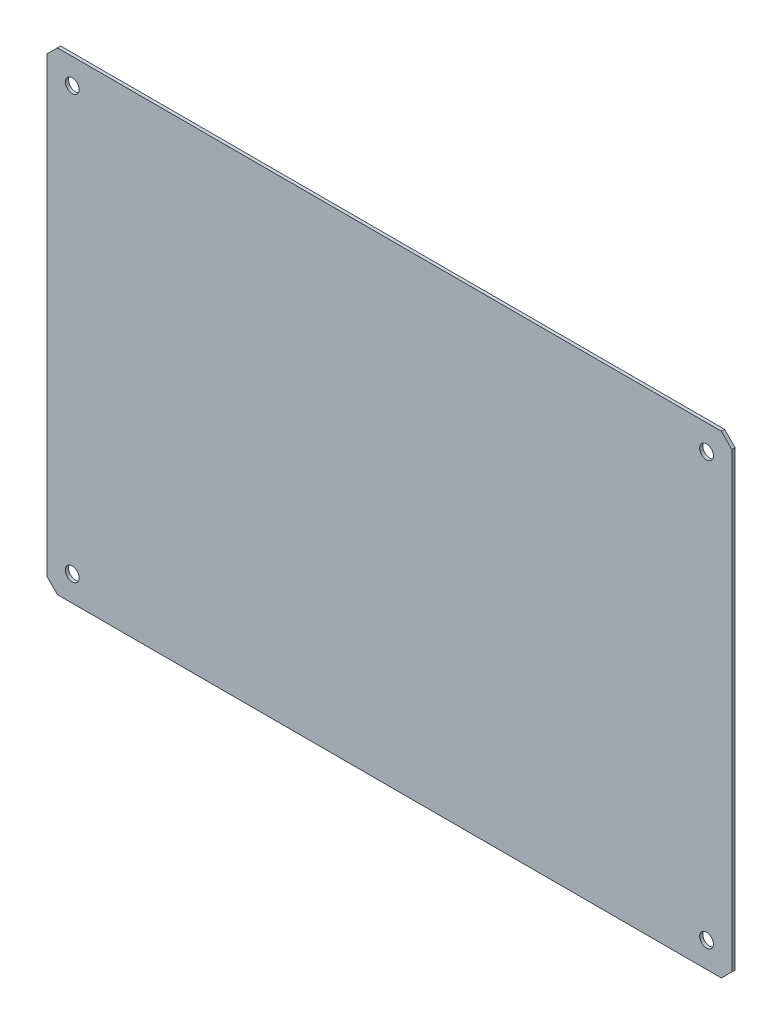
ISO-10303-21;
HEADER;
FILE_DESCRIPTION(('STEP AP214'),'2;1');
FILE_NAME('part.step','',(''),(''),'','','');
FILE_SCHEMA(('AUTOMOTIVE_DESIGN { 1 0 10303 214 1 1 1 1 }'));
ENDSEC;
DATA;
#1=APPLICATION_CONTEXT('core data for automotive mechanical design processes');
#2=APPLICATION_PROTOCOL_DEFINITION('international standard','automotive_design',2000,#1);
#3=PRODUCT_CONTEXT('',#1,'mechanical');
#4=PRODUCT('Part','Part','',(#3));
#5=PRODUCT_RELATED_PRODUCT_CATEGORY('part','',(#4));
#6=PRODUCT_DEFINITION_FORMATION('','',#4);
#7=PRODUCT_DEFINITION_CONTEXT('part definition',#1,'design');
#8=PRODUCT_DEFINITION('design','',#6,#7);
#9=PRODUCT_DEFINITION_SHAPE('','',#8);
#10=(LENGTH_UNIT() NAMED_UNIT(*) SI_UNIT(.MILLI.,.METRE.));
#11=(NAMED_UNIT(*) PLANE_ANGLE_UNIT() SI_UNIT($,.RADIAN.));
#12=(NAMED_UNIT(*) SI_UNIT($,.STERADIAN.) SOLID_ANGLE_UNIT());
#13=UNCERTAINTY_MEASURE_WITH_UNIT(LENGTH_MEASURE(1.E-05),#10,'distance_accuracy_value','');
#14=(GEOMETRIC_REPRESENTATION_CONTEXT(3) GLOBAL_UNCERTAINTY_ASSIGNED_CONTEXT((#13)) GLOBAL_UNIT_ASSIGNED_CONTEXT((#10,
#11,#12)) REPRESENTATION_CONTEXT('',''));
#15=CARTESIAN_POINT('',(0.,0.,0.));
#16=DIRECTION('',(0.,0.,1.));
#17=DIRECTION('',(1.,0.,0.));
#18=AXIS2_PLACEMENT_3D('',#15,#16,#17);
#19=CARTESIAN_POINT('',(0.,0.,1.5));
#20=DIRECTION('',(1.,0.,0.));
#21=DIRECTION('',(0.,0.,-1.));
#22=AXIS2_PLACEMENT_3D('',#19,#20,#21);
#23=PLANE('',#22);
#24=DIRECTION('',(0.,-1.,0.));
#25=VECTOR('',#24,1.);
#26=CARTESIAN_POINT('',(0.,0.,0.));
#27=LINE('',#26,#25);
#28=CARTESIAN_POINT('',(0.,219.,0.));
#29=VERTEX_POINT('',#28);
#30=CARTESIAN_POINT('',(0.,5.,0.));
#31=VERTEX_POINT('',#30);
#32=EDGE_CURVE('E133',#29,#31,#27,.T.);
#33=ORIENTED_EDGE('',*,*,#32,.T.);
#34=DIRECTION('',(0.,0.,1.));
#35=VECTOR('',#34,1.);
#36=CARTESIAN_POINT('',(0.,5.,1.5));
#37=LINE('',#36,#35);
#38=CARTESIAN_POINT('',(0.,5.,1.5));
#39=VERTEX_POINT('',#38);
#40=EDGE_CURVE('E11',#31,#39,#37,.T.);
#41=ORIENTED_EDGE('',*,*,#40,.T.);
#42=DIRECTION('',(0.,-1.,0.));
#43=VECTOR('',#42,1.);
#44=CARTESIAN_POINT('',(0.,0.,1.5));
#45=LINE('',#44,#43);
#46=CARTESIAN_POINT('',(0.,219.,1.5));
#47=VERTEX_POINT('',#46);
#48=EDGE_CURVE('E131',#47,#39,#45,.T.);
#49=ORIENTED_EDGE('',*,*,#48,.F.);
#50=DIRECTION('',(0.,0.,-1.));
#51=VECTOR('',#50,1.);
#52=CARTESIAN_POINT('',(0.,219.,1.5));
#53=LINE('',#52,#51);
#54=EDGE_CURVE('E45',#47,#29,#53,.T.);
#55=ORIENTED_EDGE('',*,*,#54,.T.);
#56=EDGE_LOOP('',(#33,#41,#49,#55));
#57=FACE_BOUND('',#56,.T.);
#58=ADVANCED_FACE('F37',(#57),#23,.F.);
#59=CARTESIAN_POINT('',(0.,0.,1.5));
#60=DIRECTION('',(0.,1.,0.));
#61=DIRECTION('',(0.,0.,1.));
#62=AXIS2_PLACEMENT_3D('',#59,#60,#61);
#63=PLANE('',#62);
#64=DIRECTION('',(1.,0.,0.));
#65=VECTOR('',#64,1.);
#66=CARTESIAN_POINT('',(0.,0.,0.));
#67=LINE('',#66,#65);
#68=CARTESIAN_POINT('',(5.,0.,0.));
#69=VERTEX_POINT('',#68);
#70=CARTESIAN_POINT('',(319.,0.,0.));
#71=VERTEX_POINT('',#70);
#72=EDGE_CURVE('E129',#69,#71,#67,.T.);
#73=ORIENTED_EDGE('',*,*,#72,.T.);
#74=DIRECTION('',(0.,0.,1.));
#75=VECTOR('',#74,1.);
#76=CARTESIAN_POINT('',(319.,0.,1.5));
#77=LINE('',#76,#75);
#78=CARTESIAN_POINT('',(319.,0.,1.5));
#79=VERTEX_POINT('',#78);
#80=EDGE_CURVE('E108',#71,#79,#77,.T.);
#81=ORIENTED_EDGE('',*,*,#80,.T.);
#82=DIRECTION('',(1.,0.,0.));
#83=VECTOR('',#82,1.);
#84=CARTESIAN_POINT('',(0.,0.,1.5));
#85=LINE('',#84,#83);
#86=CARTESIAN_POINT('',(5.,0.,1.5));
#87=VERTEX_POINT('',#86);
#88=EDGE_CURVE('E173',#87,#79,#85,.T.);
#89=ORIENTED_EDGE('',*,*,#88,.F.);
#90=DIRECTION('',(0.,0.,-1.));
#91=VECTOR('',#90,1.);
#92=CARTESIAN_POINT('',(5.,0.,1.5));
#93=LINE('',#92,#91);
#94=EDGE_CURVE('E113',#87,#69,#93,.T.);
#95=ORIENTED_EDGE('',*,*,#94,.T.);
#96=EDGE_LOOP('',(#73,#81,#89,#95));
#97=FACE_BOUND('',#96,.T.);
#98=ADVANCED_FACE('F221',(#97),#63,.F.);
#99=CARTESIAN_POINT('',(324.,0.,1.5));
#100=DIRECTION('',(-1.,0.,0.));
#101=DIRECTION('',(0.,0.,1.));
#102=AXIS2_PLACEMENT_3D('',#99,#100,#101);
#103=PLANE('',#102);
#104=DIRECTION('',(0.,1.,0.));
#105=VECTOR('',#104,1.);
#106=CARTESIAN_POINT('',(324.,0.,1.5));
#107=LINE('',#106,#105);
#108=CARTESIAN_POINT('',(324.,5.,1.5));
#109=VERTEX_POINT('',#108);
#110=CARTESIAN_POINT('',(324.,219.,1.5));
#111=VERTEX_POINT('',#110);
#112=EDGE_CURVE('E122',#109,#111,#107,.T.);
#113=ORIENTED_EDGE('',*,*,#112,.F.);
#114=DIRECTION('',(0.,0.,-1.));
#115=VECTOR('',#114,1.);
#116=CARTESIAN_POINT('',(324.,5.,1.5));
#117=LINE('',#116,#115);
#118=CARTESIAN_POINT('',(324.,5.,0.));
#119=VERTEX_POINT('',#118);
#120=EDGE_CURVE('E107',#109,#119,#117,.T.);
#121=ORIENTED_EDGE('',*,*,#120,.T.);
#122=DIRECTION('',(0.,1.,0.));
#123=VECTOR('',#122,1.);
#124=CARTESIAN_POINT('',(324.,0.,0.));
#125=LINE('',#124,#123);
#126=CARTESIAN_POINT('',(324.,219.,0.));
#127=VERTEX_POINT('',#126);
#128=EDGE_CURVE('E120',#119,#127,#125,.T.);
#129=ORIENTED_EDGE('',*,*,#128,.T.);
#130=DIRECTION('',(0.,0.,1.));
#131=VECTOR('',#130,1.);
#132=CARTESIAN_POINT('',(324.,219.,1.5));
#133=LINE('',#132,#131);
#134=EDGE_CURVE('E124',#127,#111,#133,.T.);
#135=ORIENTED_EDGE('',*,*,#134,.T.);
#136=EDGE_LOOP('',(#113,#121,#129,#135));
#137=FACE_BOUND('',#136,.T.);
#138=ADVANCED_FACE('F119',(#137),#103,.F.);
#139=CARTESIAN_POINT('',(0.,224.,1.5));
#140=DIRECTION('',(0.,-1.,0.));
#141=DIRECTION('',(0.,0.,-1.));
#142=AXIS2_PLACEMENT_3D('',#139,#140,#141);
#143=PLANE('',#142);
#144=DIRECTION('',(-1.,0.,0.));
#145=VECTOR('',#144,1.);
#146=CARTESIAN_POINT('',(0.,224.,1.5));
#147=LINE('',#146,#145);
#148=CARTESIAN_POINT('',(319.,224.,1.5));
#149=VERTEX_POINT('',#148);
#150=CARTESIAN_POINT('',(5.,224.,1.5));
#151=VERTEX_POINT('',#150);
#152=EDGE_CURVE('E137',#149,#151,#147,.T.);
#153=ORIENTED_EDGE('',*,*,#152,.F.);
#154=DIRECTION('',(0.,0.,-1.));
#155=VECTOR('',#154,1.);
#156=CARTESIAN_POINT('',(319.,224.,1.5));
#157=LINE('',#156,#155);
#158=CARTESIAN_POINT('',(319.,224.,0.));
#159=VERTEX_POINT('',#158);
#160=EDGE_CURVE('E154',#149,#159,#157,.T.);
#161=ORIENTED_EDGE('',*,*,#160,.T.);
#162=DIRECTION('',(-1.,0.,0.));
#163=VECTOR('',#162,1.);
#164=CARTESIAN_POINT('',(0.,224.,0.));
#165=LINE('',#164,#163);
#166=CARTESIAN_POINT('',(5.,224.,0.));
#167=VERTEX_POINT('',#166);
#168=EDGE_CURVE('E128',#159,#167,#165,.T.);
#169=ORIENTED_EDGE('',*,*,#168,.T.);
#170=DIRECTION('',(0.,0.,1.));
#171=VECTOR('',#170,1.);
#172=CARTESIAN_POINT('',(5.,224.,1.5));
#173=LINE('',#172,#171);
#174=EDGE_CURVE('E52',#167,#151,#173,.T.);
#175=ORIENTED_EDGE('',*,*,#174,.T.);
#176=EDGE_LOOP('',(#153,#161,#169,#175));
#177=FACE_BOUND('',#176,.T.);
#178=ADVANCED_FACE('F210',(#177),#143,.F.);
#179=CARTESIAN_POINT('',(0.,0.,1.5));
#180=DIRECTION('',(0.,0.,-1.));
#181=DIRECTION('',(-1.,0.,0.));
#182=AXIS2_PLACEMENT_3D('',#179,#180,#181);
#183=PLANE('',#182);
#184=CARTESIAN_POINT('',(12.,212.,1.5));
#185=DIRECTION('',(0.,0.,-1.));
#186=DIRECTION('',(-1.,0.,0.));
#187=AXIS2_PLACEMENT_3D('',#184,#185,#186);
#188=CIRCLE('',#187,3.25);
#189=CARTESIAN_POINT('',(8.74999999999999,212.,1.5));
#190=VERTEX_POINT('',#189);
#191=EDGE_CURVE('E191',#190,#190,#188,.T.);
#192=ORIENTED_EDGE('',*,*,#191,.T.);
#193=EDGE_LOOP('',(#192));
#194=FACE_BOUND('',#193,.T.);
#195=CARTESIAN_POINT('',(12.,12.,1.5));
#196=DIRECTION('',(0.,0.,-1.));
#197=DIRECTION('',(-1.,0.,0.));
#198=AXIS2_PLACEMENT_3D('',#195,#196,#197);
#199=CIRCLE('',#198,3.25);
#200=CARTESIAN_POINT('',(8.75000000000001,12.,1.5));
#201=VERTEX_POINT('',#200);
#202=EDGE_CURVE('E185',#201,#201,#199,.T.);
#203=ORIENTED_EDGE('',*,*,#202,.T.);
#204=EDGE_LOOP('',(#203));
#205=FACE_BOUND('',#204,.T.);
#206=CARTESIAN_POINT('',(312.,212.,1.5));
#207=DIRECTION('',(0.,0.,-1.));
#208=DIRECTION('',(-1.,0.,0.));
#209=AXIS2_PLACEMENT_3D('',#206,#207,#208);
#210=CIRCLE('',#209,3.24999999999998);
#211=CARTESIAN_POINT('',(308.75,212.,1.5));
#212=VERTEX_POINT('',#211);
#213=EDGE_CURVE('E179',#212,#212,#210,.T.);
#214=ORIENTED_EDGE('',*,*,#213,.T.);
#215=EDGE_LOOP('',(#214));
#216=FACE_BOUND('',#215,.T.);
#217=CARTESIAN_POINT('',(312.,12.,1.5));
#218=DIRECTION('',(0.,0.,-1.));
#219=DIRECTION('',(-1.,0.,0.));
#220=AXIS2_PLACEMENT_3D('',#217,#218,#219);
#221=CIRCLE('',#220,3.24999999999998);
#222=CARTESIAN_POINT('',(308.75,12.,1.5));
#223=VERTEX_POINT('',#222);
#224=EDGE_CURVE('E166',#223,#223,#221,.T.);
#225=ORIENTED_EDGE('',*,*,#224,.T.);
#226=EDGE_LOOP('',(#225));
#227=FACE_BOUND('',#226,.T.);
#228=ORIENTED_EDGE('',*,*,#88,.T.);
#229=DIRECTION('',(-0.707106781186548,-0.707106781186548,0.));
#230=VECTOR('',#229,1.);
#231=CARTESIAN_POINT('',(324.,5.,1.5));
#232=LINE('',#231,#230);
#233=EDGE_CURVE('E151',#79,#109,#232,.F.);
#234=ORIENTED_EDGE('',*,*,#233,.T.);
#235=ORIENTED_EDGE('',*,*,#112,.T.);
#236=DIRECTION('',(0.707106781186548,-0.707106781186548,0.));
#237=VECTOR('',#236,1.);
#238=CARTESIAN_POINT('',(319.,224.,1.5));
#239=LINE('',#238,#237);
#240=EDGE_CURVE('E59',#111,#149,#239,.F.);
#241=ORIENTED_EDGE('',*,*,#240,.T.);
#242=ORIENTED_EDGE('',*,*,#152,.T.);
#243=DIRECTION('',(0.707106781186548,0.707106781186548,0.));
#244=VECTOR('',#243,1.);
#245=CARTESIAN_POINT('',(0.,219.,1.5));
#246=LINE('',#245,#244);
#247=EDGE_CURVE('E146',#151,#47,#246,.F.);
#248=ORIENTED_EDGE('',*,*,#247,.T.);
#249=ORIENTED_EDGE('',*,*,#48,.T.);
#250=DIRECTION('',(-0.707106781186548,0.707106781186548,0.));
#251=VECTOR('',#250,1.);
#252=CARTESIAN_POINT('',(5.,0.,1.5));
#253=LINE('',#252,#251);
#254=EDGE_CURVE('E148',#39,#87,#253,.F.);
#255=ORIENTED_EDGE('',*,*,#254,.T.);
#256=EDGE_LOOP('',(#228,#234,#235,#241,#242,#248,#249,#255));
#257=FACE_BOUND('',#256,.T.);
#258=ADVANCED_FACE('F207',(#194,#205,#216,#227,#257),#183,.F.);
#259=CARTESIAN_POINT('',(0.,0.,0.));
#260=DIRECTION('',(0.,0.,-1.));
#261=DIRECTION('',(-1.,0.,0.));
#262=AXIS2_PLACEMENT_3D('',#259,#260,#261);
#263=PLANE('',#262);
#264=CARTESIAN_POINT('',(12.,212.,0.));
#265=DIRECTION('',(0.,0.,1.));
#266=DIRECTION('',(1.,0.,0.));
#267=AXIS2_PLACEMENT_3D('',#264,#265,#266);
#268=CIRCLE('',#267,3.25);
#269=CARTESIAN_POINT('',(15.25,212.,0.));
#270=VERTEX_POINT('',#269);
#271=EDGE_CURVE('E194',#270,#270,#268,.T.);
#272=ORIENTED_EDGE('',*,*,#271,.T.);
#273=EDGE_LOOP('',(#272));
#274=FACE_BOUND('',#273,.T.);
#275=CARTESIAN_POINT('',(12.,12.,0.));
#276=DIRECTION('',(0.,0.,1.));
#277=DIRECTION('',(1.,0.,0.));
#278=AXIS2_PLACEMENT_3D('',#275,#276,#277);
#279=CIRCLE('',#278,3.25);
#280=CARTESIAN_POINT('',(15.25,12.,0.));
#281=VERTEX_POINT('',#280);
#282=EDGE_CURVE('E188',#281,#281,#279,.T.);
#283=ORIENTED_EDGE('',*,*,#282,.T.);
#284=EDGE_LOOP('',(#283));
#285=FACE_BOUND('',#284,.T.);
#286=CARTESIAN_POINT('',(312.,212.,0.));
#287=DIRECTION('',(0.,0.,1.));
#288=DIRECTION('',(1.,0.,0.));
#289=AXIS2_PLACEMENT_3D('',#286,#287,#288);
#290=CIRCLE('',#289,3.24999999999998);
#291=CARTESIAN_POINT('',(315.25,212.,0.));
#292=VERTEX_POINT('',#291);
#293=EDGE_CURVE('E182',#292,#292,#290,.T.);
#294=ORIENTED_EDGE('',*,*,#293,.T.);
#295=EDGE_LOOP('',(#294));
#296=FACE_BOUND('',#295,.T.);
#297=CARTESIAN_POINT('',(312.,12.,0.));
#298=DIRECTION('',(0.,0.,1.));
#299=DIRECTION('',(1.,0.,0.));
#300=AXIS2_PLACEMENT_3D('',#297,#298,#299);
#301=CIRCLE('',#300,3.24999999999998);
#302=CARTESIAN_POINT('',(315.25,12.,0.));
#303=VERTEX_POINT('',#302);
#304=EDGE_CURVE('E168',#303,#303,#301,.T.);
#305=ORIENTED_EDGE('',*,*,#304,.T.);
#306=EDGE_LOOP('',(#305));
#307=FACE_BOUND('',#306,.T.);
#308=ORIENTED_EDGE('',*,*,#128,.F.);
#309=DIRECTION('',(0.707106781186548,0.707106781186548,0.));
#310=VECTOR('',#309,1.);
#311=CARTESIAN_POINT('',(159.5,-159.5,0.));
#312=LINE('',#311,#310);
#313=EDGE_CURVE('E103',#119,#71,#312,.F.);
#314=ORIENTED_EDGE('',*,*,#313,.T.);
#315=ORIENTED_EDGE('',*,*,#72,.F.);
#316=DIRECTION('',(0.707106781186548,-0.707106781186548,0.));
#317=VECTOR('',#316,1.);
#318=CARTESIAN_POINT('',(2.5,2.5,0.));
#319=LINE('',#318,#317);
#320=EDGE_CURVE('E140',#69,#31,#319,.F.);
#321=ORIENTED_EDGE('',*,*,#320,.T.);
#322=ORIENTED_EDGE('',*,*,#32,.F.);
#323=DIRECTION('',(-0.707106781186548,-0.707106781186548,0.));
#324=VECTOR('',#323,1.);
#325=CARTESIAN_POINT('',(-109.5,109.5,0.));
#326=LINE('',#325,#324);
#327=EDGE_CURVE('E123',#29,#167,#326,.F.);
#328=ORIENTED_EDGE('',*,*,#327,.T.);
#329=ORIENTED_EDGE('',*,*,#168,.F.);
#330=DIRECTION('',(-0.707106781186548,0.707106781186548,0.));
#331=VECTOR('',#330,1.);
#332=CARTESIAN_POINT('',(271.5,271.5,0.));
#333=LINE('',#332,#331);
#334=EDGE_CURVE('E114',#159,#127,#333,.F.);
#335=ORIENTED_EDGE('',*,*,#334,.T.);
#336=EDGE_LOOP('',(#308,#314,#315,#321,#322,#328,#329,#335));
#337=FACE_BOUND('',#336,.T.);
#338=ADVANCED_FACE('F126',(#274,#285,#296,#307,#337),#263,.T.);
#339=CARTESIAN_POINT('',(312.,12.,1.5));
#340=DIRECTION('',(0.,0.,1.));
#341=DIRECTION('',(1.,0.,0.));
#342=AXIS2_PLACEMENT_3D('',#339,#340,#341);
#343=CYLINDRICAL_SURFACE('',#342,3.24999999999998);
#344=ORIENTED_EDGE('',*,*,#304,.F.);
#345=EDGE_LOOP('',(#344));
#346=FACE_BOUND('',#345,.T.);
#347=ORIENTED_EDGE('',*,*,#224,.F.);
#348=EDGE_LOOP('',(#347));
#349=FACE_BOUND('',#348,.T.);
#350=ADVANCED_FACE('F251',(#346,#349),#343,.F.);
#351=CARTESIAN_POINT('',(312.,212.,1.5));
#352=DIRECTION('',(0.,0.,1.));
#353=DIRECTION('',(1.,0.,0.));
#354=AXIS2_PLACEMENT_3D('',#351,#352,#353);
#355=CYLINDRICAL_SURFACE('',#354,3.24999999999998);
#356=ORIENTED_EDGE('',*,*,#293,.F.);
#357=EDGE_LOOP('',(#356));
#358=FACE_BOUND('',#357,.T.);
#359=ORIENTED_EDGE('',*,*,#213,.F.);
#360=EDGE_LOOP('',(#359));
#361=FACE_BOUND('',#360,.T.);
#362=ADVANCED_FACE('F255',(#358,#361),#355,.F.);
#363=CARTESIAN_POINT('',(12.,12.,1.5));
#364=DIRECTION('',(0.,0.,1.));
#365=DIRECTION('',(1.,0.,0.));
#366=AXIS2_PLACEMENT_3D('',#363,#364,#365);
#367=CYLINDRICAL_SURFACE('',#366,3.25);
#368=ORIENTED_EDGE('',*,*,#282,.F.);
#369=EDGE_LOOP('',(#368));
#370=FACE_BOUND('',#369,.T.);
#371=ORIENTED_EDGE('',*,*,#202,.F.);
#372=EDGE_LOOP('',(#371));
#373=FACE_BOUND('',#372,.T.);
#374=ADVANCED_FACE('F203',(#370,#373),#367,.F.);
#375=CARTESIAN_POINT('',(12.,212.,1.5));
#376=DIRECTION('',(0.,0.,1.));
#377=DIRECTION('',(1.,0.,0.));
#378=AXIS2_PLACEMENT_3D('',#375,#376,#377);
#379=CYLINDRICAL_SURFACE('',#378,3.25);
#380=ORIENTED_EDGE('',*,*,#271,.F.);
#381=EDGE_LOOP('',(#380));
#382=FACE_BOUND('',#381,.T.);
#383=ORIENTED_EDGE('',*,*,#191,.F.);
#384=EDGE_LOOP('',(#383));
#385=FACE_BOUND('',#384,.T.);
#386=ADVANCED_FACE('F200',(#382,#385),#379,.F.);
#387=CARTESIAN_POINT('',(324.,5.,1.5));
#388=DIRECTION('',(-0.707106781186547,0.707106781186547,0.));
#389=DIRECTION('',(0.,0.,-1.));
#390=AXIS2_PLACEMENT_3D('',#387,#388,#389);
#391=PLANE('',#390);
#392=ORIENTED_EDGE('',*,*,#233,.F.);
#393=ORIENTED_EDGE('',*,*,#80,.F.);
#394=ORIENTED_EDGE('',*,*,#313,.F.);
#395=ORIENTED_EDGE('',*,*,#120,.F.);
#396=EDGE_LOOP('',(#392,#393,#394,#395));
#397=FACE_BOUND('',#396,.T.);
#398=ADVANCED_FACE('F106',(#397),#391,.F.);
#399=CARTESIAN_POINT('',(319.,224.,1.5));
#400=DIRECTION('',(-0.707106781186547,-0.707106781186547,0.));
#401=DIRECTION('',(0.,0.,-1.));
#402=AXIS2_PLACEMENT_3D('',#399,#400,#401);
#403=PLANE('',#402);
#404=ORIENTED_EDGE('',*,*,#240,.F.);
#405=ORIENTED_EDGE('',*,*,#134,.F.);
#406=ORIENTED_EDGE('',*,*,#334,.F.);
#407=ORIENTED_EDGE('',*,*,#160,.F.);
#408=EDGE_LOOP('',(#404,#405,#406,#407));
#409=FACE_BOUND('',#408,.T.);
#410=ADVANCED_FACE('F228',(#409),#403,.F.);
#411=CARTESIAN_POINT('',(5.,0.,1.5));
#412=DIRECTION('',(0.707106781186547,0.707106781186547,0.));
#413=DIRECTION('',(0.,0.,-1.));
#414=AXIS2_PLACEMENT_3D('',#411,#412,#413);
#415=PLANE('',#414);
#416=ORIENTED_EDGE('',*,*,#254,.F.);
#417=ORIENTED_EDGE('',*,*,#40,.F.);
#418=ORIENTED_EDGE('',*,*,#320,.F.);
#419=ORIENTED_EDGE('',*,*,#94,.F.);
#420=EDGE_LOOP('',(#416,#417,#418,#419));
#421=FACE_BOUND('',#420,.T.);
#422=ADVANCED_FACE('F223',(#421),#415,.F.);
#423=CARTESIAN_POINT('',(0.,219.,1.5));
#424=DIRECTION('',(0.707106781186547,-0.707106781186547,0.));
#425=DIRECTION('',(0.,0.,-1.));
#426=AXIS2_PLACEMENT_3D('',#423,#424,#425);
#427=PLANE('',#426);
#428=ORIENTED_EDGE('',*,*,#247,.F.);
#429=ORIENTED_EDGE('',*,*,#174,.F.);
#430=ORIENTED_EDGE('',*,*,#327,.F.);
#431=ORIENTED_EDGE('',*,*,#54,.F.);
#432=EDGE_LOOP('',(#428,#429,#430,#431));
#433=FACE_BOUND('',#432,.T.);
#434=ADVANCED_FACE('F39',(#433),#427,.F.);
#435=CLOSED_SHELL('',(#58,#98,#138,#178,#258,#338,#350,#362,#374,#386,#398,#410,#422,#434));
#436=MANIFOLD_SOLID_BREP('B2',#435);
#437=ADVANCED_BREP_SHAPE_REPRESENTATION('',(#18,#436),#14);
#438=SHAPE_DEFINITION_REPRESENTATION(#9,#437);
ENDSEC;
END-ISO-10303-21;
